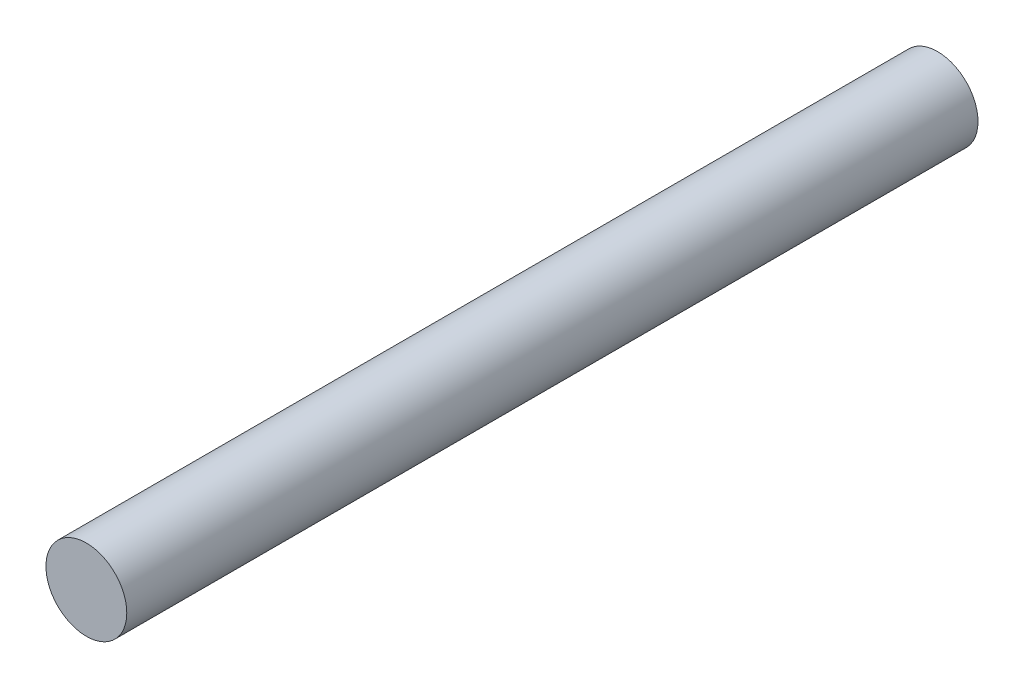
from build123d import *

# Parameters (mm, degrees)
SKETCH1_R           = 4.826
BOSS_EXTRUDE1_DEPTH = 101.6


with BuildPart() as part:
    # Sketch1 → Boss-Extrude1 (new body)
    with BuildSketch(Plane.XY):
        Circle(SKETCH1_R)
    extrude(amount=BOSS_EXTRUDE1_DEPTH)


solid = part.part
